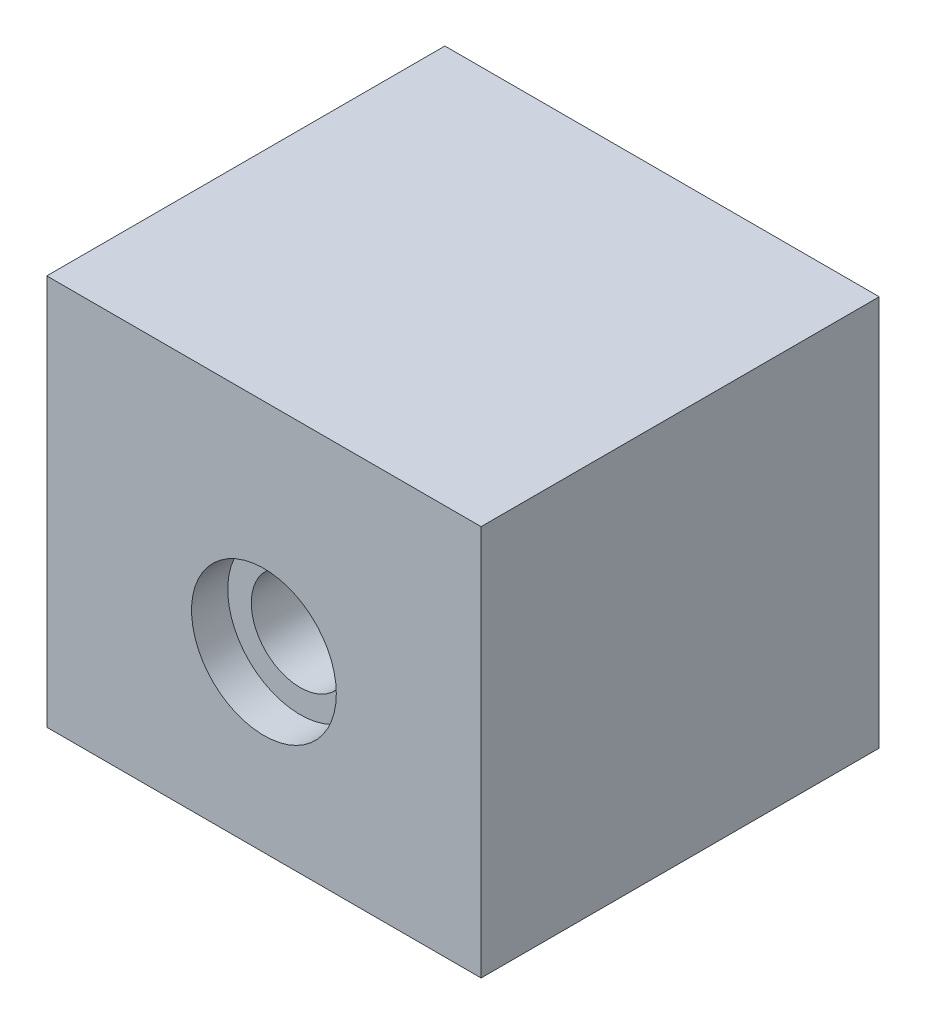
from build123d import *

# Parameters (mm, degrees)
ESQUISSE1_W             = 30
ESQUISSE1_H             = 27
ESQUISSE1_R             = 3.375
BASE_EXTRUSION_DEPTH    = 13.75
ESQUISSE2_R             = 5
ENL_V_MAT_EXTRU_1_DEPTH = 2.5


with BuildPart() as part:
    # Esquisse1 → Base-Extrusion (new, symmetric)
    with BuildSketch(Plane.XY):
        with Locations((0, 1.5)):
            Rectangle(ESQUISSE1_W, ESQUISSE1_H)
        Circle(ESQUISSE1_R, mode=Mode.SUBTRACT)
    extrude(amount=BASE_EXTRUSION_DEPTH, both=True)

    # Esquisse2 → Enl_v. mat.-Extru.1 (cut)
    with BuildSketch(Plane.XY.offset(13.75)):
        Circle(ESQUISSE2_R)
    extrude(amount=-ENL_V_MAT_EXTRU_1_DEPTH, mode=Mode.SUBTRACT)


solid = part.part
